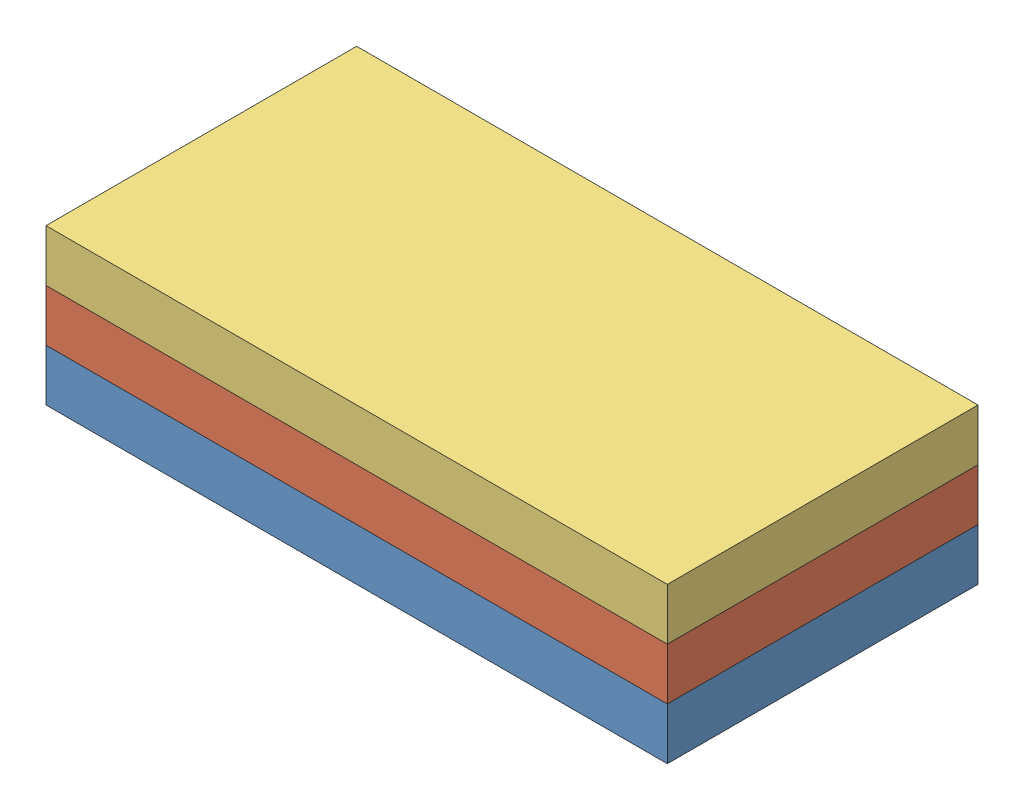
SolidWorks assembly Plate Assy.SLDASM, configuration Default (file format 4052). Lengths in mm.
Overall size (152.4 38.1 76.2).
3 component instances, 3 part files, 6 mates.
Components (placement in the parent):
- Plate 1-1: Plate 1.SLDPRT [Default] at origin size (152.4 12.7 76.2)
- Plate 2-1: Plate 2.SLDPRT [Default] at (152.4 25.4 0) x (-1 0 0) z (0 0 1) size (152.4 12.7 76.2)
- Plate 3-1: Plate 3.SLDPRT [Default] at (0 25.4 0) size (152.4 12.7 76.2)
Mates (geometry in assembly coordinates):
- Coincident1: coincident aligned: plane of Plate 1-1 through (0 12.7 0) normal (0 0 1); plane of Plate 2-1 through (152.4 12.7 0) normal (0 0 1)
- Coincident2: coincident aligned: plane of Plate 1-1 through (152.4 12.7 0) normal (1 0 0); plane of Plate 2-1 through (152.4 12.7 0) normal (1 0 0)
- Coincident3: coincident anti-aligned: plane of Plate 1-1 through (0 12.7 -76.2) normal (0 1 0); plane of Plate 2-1 through (152.4 12.7 -76.2) normal (0 -1 0)
- Coincident4: coincident anti-aligned: plane of Plate 2-1 through (152.4 25.4 -76.2) normal (0 1 0); plane of Plate 3-1 through (0 25.4 -76.2) normal (0 -1 0)
- Coincident5: coincident aligned: plane of Plate 2-1 through (152.4 12.7 0) normal (0 0 1); plane of Plate 3-1 through (0 38.1 0) normal (0 0 1)
- Coincident6: coincident aligned: plane of Plate 2-1 through (152.4 12.7 0) normal (1 0 0); plane of Plate 3-1 through (152.4 38.1 0) normal (1 0 0)
